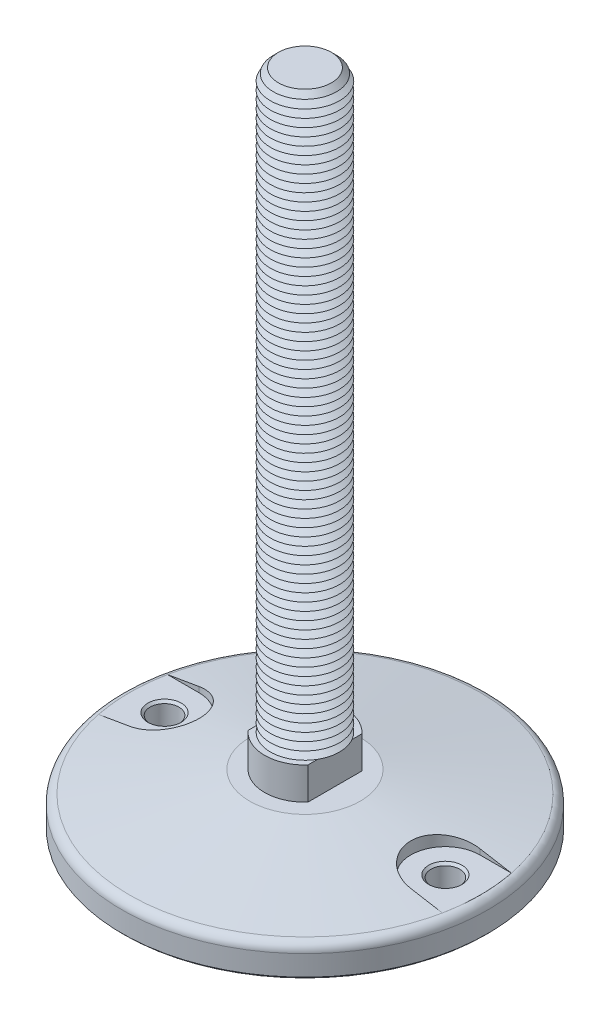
from build123d import *

# Parameters (mm, degrees)
FILLET1_R                = 4
SKETCH3_R                = 17.5
BOSS_EXTRUDE1_DEPTH      = 14
CUT_EXTRUDE1_START       = -14
CUT_EXTRUDE1_DEPTH       = 14
SKETCH5_R                = 15
BOSS_EXTRUDE2_DEPTH      = 250
CHAMFER1_SIZE            = 3.5
LPATTERN1_COUNT          = 71
LPATTERN1_PITCH          = 3.5
CUT_EXTRUDE4_DEPTH       = 9.2
SKETCH10_R               = 6.25
CUT_EXTRUDE5_DEPTH       = 13.8
CHAMFER2_SIZE            = 1
CHAMFER2_OF_MIRROR1_SIZE = 1
CHAMFER3_SIZE            = 1


with BuildPart() as part:
    # Sketch2 → Revolve1 (revolve)
    with BuildSketch(Plane(origin=(0, 0, 0), x_dir=(0, 0, -1), z_dir=(1, 0, 0)), mode=Mode.PRIVATE) as revolve1_sk:
        Polygon((0, 0), (-24, 0), (-79.5, -9.786147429), (-79.5, -23), (0, -23), align=None)
    revolve(revolve1_sk.sketch.rotate(Axis((0, 61.338865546, 0), (0, -1, 0)), 180), axis=Axis((0, 61.338865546, 0), (0, -1, 0)))

    # Fillet1
    fillet1_edges = [part.edges().sort_by_distance(p)[0] for p in [
        (0, -9.786147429, 79.5),
    ]]
    fillet(fillet1_edges, radius=FILLET1_R)

    # Sketch3 → Boss-Extrude1 (add)
    with BuildSketch(Plane(origin=(0, 0, 0), x_dir=(1, 0, 0), z_dir=(0, 1, 0))):
        with Locations(Location((0, 0, 0), (0, 0, 270))):
            Circle(SKETCH3_R)
    extrude(amount=BOSS_EXTRUDE1_DEPTH)

    # Sketch4 → Cut-Extrude1 (cut)
    with BuildSketch(Plane(origin=(0, 14, 0), x_dir=(1, 0, 0), z_dir=(0, 1, 0)).offset(CUT_EXTRUDE1_START)):
        with BuildLine():
            Line((-13, 11.715374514), (-13, -11.715374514))
            ThreePointArc((-13, -11.715374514), (-17.5, 0), (-13, 11.715374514))
        make_face()
        with BuildLine():
            Line((13, -11.715374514), (13, 11.715374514))
            ThreePointArc((13, 11.715374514), (17.5, 0), (13, -11.715374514))
        make_face()
    extrude(amount=CUT_EXTRUDE1_DEPTH, mode=Mode.SUBTRACT)

    # Sketch5 → Boss-Extrude2 (add)
    with BuildSketch(Plane(origin=(0, 14, 0), x_dir=(1, 0, 0), z_dir=(0, 1, 0))):
        with Locations(Location((0, 0, 0), (0, 0, 29.926434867))):
            Circle(SKETCH5_R)
    extrude(amount=BOSS_EXTRUDE2_DEPTH)

    # Chamfer1
    chamfer1_edges = [part.edges().sort_by_distance(p)[0] for p in [
        (-13, 264, 7.483314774),
    ]]
    chamfer(chamfer1_edges, length=CHAMFER1_SIZE)

    # Sketch6 → Cut-Revolve1 (revolve, cut)
    with BuildSketch(Plane(origin=(0, 0, 0), x_dir=(0, 0, -1), z_dir=(1, 0, 0)), mode=Mode.PRIVATE) as cut_revolve1_sk:
        Polygon((-15, 14), (-11.968911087, 15.75), (-15, 17.5), align=None)
    cut_revolve1 = revolve(cut_revolve1_sk.sketch.rotate(Axis((0, 61.338865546, 0), (0, -1, 0)), 180), axis=Axis((0, 61.338865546, 0), (0, -1, 0)), mode=Mode.SUBTRACT)

    # LPattern1: Cut-Revolve1 ×71
    with Locations(*[(0, i * LPATTERN1_PITCH, 0) for i in range(1, LPATTERN1_COUNT)]):
        add(cut_revolve1, mode=Mode.SUBTRACT)

    # Sketch8 → Cut-Extrude4 (cut)
    with BuildSketch(Plane(origin=(0, 0, 0), x_dir=(1, 0, 0), z_dir=(0, 1, 0))):
        with BuildLine():
            Line((-61, 15), (-74.703520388, 15))
            ThreePointArc((-74.703520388, 15), (-76.194592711, 0), (-74.703520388, -15))
            Line((-74.703520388, -15), (-61, -15))
            ThreePointArc((-61, -15), (-46, 0), (-61, 15))
        make_face()
    cut_extrude4 = extrude(amount=-CUT_EXTRUDE4_DEPTH, mode=Mode.SUBTRACT)

    # Sketch10 → Cut-Extrude5 (cut)
    with BuildSketch(Plane(origin=(0, -9.2, 0), x_dir=(1, 0, 0), z_dir=(0, 1, 0))):
        with Locations(Location((-61, 0, 0), (0, 0, 270))):
            Circle(SKETCH10_R)
    cut_extrude5 = extrude(amount=-CUT_EXTRUDE5_DEPTH, mode=Mode.SUBTRACT)

    # Chamfer2
    chamfer2_edges = [part.edges().sort_by_distance(p)[0] for p in [
        (-61, -9.2, -6.25),
        (-61, -23, -6.25),
    ]]
    chamfer(chamfer2_edges, length=CHAMFER2_SIZE)

    # Mirror1: Cut-Extrude4, Cut-Extrude5 across plane
    add(cut_extrude4.mirror(Plane(origin=(0, 0, 0), x_dir=(0, 0, 1), z_dir=(1, 0, 0))), mode=Mode.SUBTRACT)
    add(cut_extrude5.mirror(Plane(origin=(0, 0, 0), x_dir=(0, 0, 1), z_dir=(1, 0, 0))), mode=Mode.SUBTRACT)

    # Chamfer2 of Mirror1
    chamfer2_of_mirror1_edges = [part.edges().sort_by_distance(p)[0] for p in [
        (61, -9.2, -6.25),
        (61, -23, -6.25),
    ]]
    chamfer(chamfer2_of_mirror1_edges, length=CHAMFER2_OF_MIRROR1_SIZE)

    # Chamfer3
    chamfer3_edges = [part.edges().sort_by_distance(p)[0] for p in [
        (0, -23, 79.5),
    ]]
    chamfer(chamfer3_edges, length=CHAMFER3_SIZE)


solid = part.part
